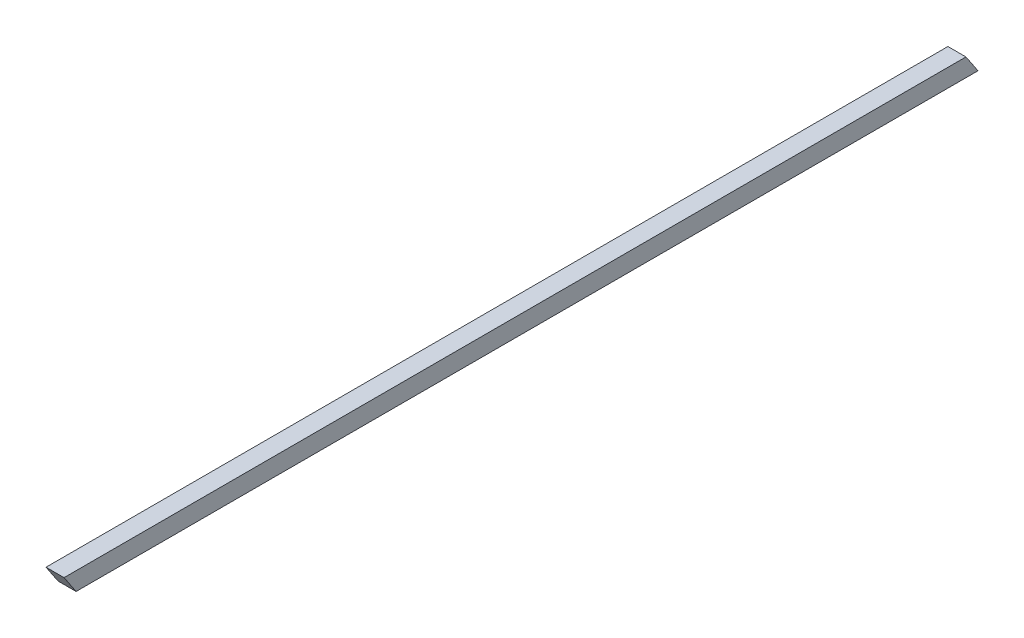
ISO-10303-21;
HEADER;
FILE_DESCRIPTION(('STEP AP214'),'2;1');
FILE_NAME('part.step','',(''),(''),'','','');
FILE_SCHEMA(('AUTOMOTIVE_DESIGN { 1 0 10303 214 1 1 1 1 }'));
ENDSEC;
DATA;
#1=APPLICATION_CONTEXT('core data for automotive mechanical design processes');
#2=APPLICATION_PROTOCOL_DEFINITION('international standard','automotive_design',2000,#1);
#3=PRODUCT_CONTEXT('',#1,'mechanical');
#4=PRODUCT('Part','Part','',(#3));
#5=PRODUCT_RELATED_PRODUCT_CATEGORY('part','',(#4));
#6=PRODUCT_DEFINITION_FORMATION('','',#4);
#7=PRODUCT_DEFINITION_CONTEXT('part definition',#1,'design');
#8=PRODUCT_DEFINITION('design','',#6,#7);
#9=PRODUCT_DEFINITION_SHAPE('','',#8);
#10=(LENGTH_UNIT() NAMED_UNIT(*) SI_UNIT(.MILLI.,.METRE.));
#11=(NAMED_UNIT(*) PLANE_ANGLE_UNIT() SI_UNIT($,.RADIAN.));
#12=(NAMED_UNIT(*) SI_UNIT($,.STERADIAN.) SOLID_ANGLE_UNIT());
#13=UNCERTAINTY_MEASURE_WITH_UNIT(LENGTH_MEASURE(1.E-05),#10,'distance_accuracy_value','');
#14=(GEOMETRIC_REPRESENTATION_CONTEXT(3) GLOBAL_UNCERTAINTY_ASSIGNED_CONTEXT((#13)) GLOBAL_UNIT_ASSIGNED_CONTEXT((#10,
#11,#12)) REPRESENTATION_CONTEXT('',''));
#15=CARTESIAN_POINT('',(0.,0.,0.));
#16=DIRECTION('',(0.,0.,1.));
#17=DIRECTION('',(1.,0.,0.));
#18=AXIS2_PLACEMENT_3D('',#15,#16,#17);
#19=CARTESIAN_POINT('',(-2.,2.,100.));
#20=DIRECTION('',(1.,0.,0.));
#21=DIRECTION('',(0.,0.,-1.));
#22=AXIS2_PLACEMENT_3D('',#19,#20,#21);
#23=PLANE('',#22);
#24=DIRECTION('',(0.,0.,-1.));
#25=VECTOR('',#24,1.);
#26=CARTESIAN_POINT('',(-2.,2.,100.));
#27=LINE('',#26,#25);
#28=CARTESIAN_POINT('',(-2.,2.,102.674337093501));
#29=VERTEX_POINT('',#28);
#30=CARTESIAN_POINT('',(-2.,2.,-97.3256629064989));
#31=VERTEX_POINT('',#30);
#32=EDGE_CURVE('E65',#29,#31,#27,.T.);
#33=ORIENTED_EDGE('',*,*,#32,.T.);
#34=DIRECTION('',(0.,0.831313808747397,0.555803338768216));
#35=VECTOR('',#34,1.);
#36=CARTESIAN_POINT('',(-2.,-2.,-100.));
#37=LINE('',#36,#35);
#38=CARTESIAN_POINT('',(-2.,-2.,-100.));
#39=VERTEX_POINT('',#38);
#40=EDGE_CURVE('E83',#39,#31,#37,.T.);
#41=ORIENTED_EDGE('',*,*,#40,.F.);
#42=DIRECTION('',(0.,0.,-1.));
#43=VECTOR('',#42,1.);
#44=CARTESIAN_POINT('',(-2.,-2.,100.));
#45=LINE('',#44,#43);
#46=CARTESIAN_POINT('',(-2.,-2.,100.));
#47=VERTEX_POINT('',#46);
#48=EDGE_CURVE('E11',#47,#39,#45,.T.);
#49=ORIENTED_EDGE('',*,*,#48,.F.);
#50=DIRECTION('',(0.,0.831313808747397,0.555803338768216));
#51=VECTOR('',#50,1.);
#52=CARTESIAN_POINT('',(-2.,2.,102.674337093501));
#53=LINE('',#52,#51);
#54=EDGE_CURVE('E80',#47,#29,#53,.T.);
#55=ORIENTED_EDGE('',*,*,#54,.T.);
#56=EDGE_LOOP('',(#33,#41,#49,#55));
#57=FACE_BOUND('',#56,.T.);
#58=ADVANCED_FACE('F26',(#57),#23,.F.);
#59=CARTESIAN_POINT('',(-2.,-2.,100.));
#60=DIRECTION('',(0.,1.,0.));
#61=DIRECTION('',(0.,0.,1.));
#62=AXIS2_PLACEMENT_3D('',#59,#60,#61);
#63=PLANE('',#62);
#64=DIRECTION('',(1.,0.,0.));
#65=VECTOR('',#64,1.);
#66=CARTESIAN_POINT('',(-2.,-2.,-100.));
#67=LINE('',#66,#65);
#68=CARTESIAN_POINT('',(2.,-2.,-100.));
#69=VERTEX_POINT('',#68);
#70=EDGE_CURVE('E93',#39,#69,#67,.T.);
#71=ORIENTED_EDGE('',*,*,#70,.T.);
#72=DIRECTION('',(0.,0.,-1.));
#73=VECTOR('',#72,1.);
#74=CARTESIAN_POINT('',(2.,-2.,100.));
#75=LINE('',#74,#73);
#76=CARTESIAN_POINT('',(2.,-2.,100.));
#77=VERTEX_POINT('',#76);
#78=EDGE_CURVE('E33',#77,#69,#75,.T.);
#79=ORIENTED_EDGE('',*,*,#78,.F.);
#80=DIRECTION('',(1.,0.,0.));
#81=VECTOR('',#80,1.);
#82=CARTESIAN_POINT('',(-2.,-2.,100.));
#83=LINE('',#82,#81);
#84=EDGE_CURVE('E42',#47,#77,#83,.T.);
#85=ORIENTED_EDGE('',*,*,#84,.F.);
#86=ORIENTED_EDGE('',*,*,#48,.T.);
#87=EDGE_LOOP('',(#71,#79,#85,#86));
#88=FACE_BOUND('',#87,.T.);
#89=ADVANCED_FACE('F100',(#88),#63,.F.);
#90=CARTESIAN_POINT('',(2.,2.,100.));
#91=DIRECTION('',(-1.,0.,0.));
#92=DIRECTION('',(0.,-1.,0.));
#93=AXIS2_PLACEMENT_3D('',#90,#91,#92);
#94=PLANE('',#93);
#95=ORIENTED_EDGE('',*,*,#78,.T.);
#96=DIRECTION('',(0.,0.831313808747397,0.555803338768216));
#97=VECTOR('',#96,1.);
#98=CARTESIAN_POINT('',(1.99999999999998,93.1737286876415,-36.3683417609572));
#99=LINE('',#98,#97);
#100=CARTESIAN_POINT('',(2.,2.,-97.3256629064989));
#101=VERTEX_POINT('',#100);
#102=EDGE_CURVE('E90',#69,#101,#99,.T.);
#103=ORIENTED_EDGE('',*,*,#102,.T.);
#104=DIRECTION('',(0.,0.,-1.));
#105=VECTOR('',#104,1.);
#106=CARTESIAN_POINT('',(2.,2.,100.));
#107=LINE('',#106,#105);
#108=CARTESIAN_POINT('',(2.,2.,102.674337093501));
#109=VERTEX_POINT('',#108);
#110=EDGE_CURVE('E75',#109,#101,#107,.T.);
#111=ORIENTED_EDGE('',*,*,#110,.F.);
#112=DIRECTION('',(0.,0.831313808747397,0.555803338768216));
#113=VECTOR('',#112,1.);
#114=CARTESIAN_POINT('',(2.,2.,102.674337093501));
#115=LINE('',#114,#113);
#116=EDGE_CURVE('E82',#77,#109,#115,.T.);
#117=ORIENTED_EDGE('',*,*,#116,.F.);
#118=EDGE_LOOP('',(#95,#103,#111,#117));
#119=FACE_BOUND('',#118,.T.);
#120=ADVANCED_FACE('F97',(#119),#94,.F.);
#121=CARTESIAN_POINT('',(-2.,2.,100.));
#122=DIRECTION('',(0.,-1.,0.));
#123=DIRECTION('',(1.,0.,0.));
#124=AXIS2_PLACEMENT_3D('',#121,#122,#123);
#125=PLANE('',#124);
#126=ORIENTED_EDGE('',*,*,#110,.T.);
#127=DIRECTION('',(-1.,0.,0.));
#128=VECTOR('',#127,1.);
#129=CARTESIAN_POINT('',(298.,2.,-97.3256629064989));
#130=LINE('',#129,#128);
#131=EDGE_CURVE('E71',#101,#31,#130,.T.);
#132=ORIENTED_EDGE('',*,*,#131,.T.);
#133=ORIENTED_EDGE('',*,*,#32,.F.);
#134=DIRECTION('',(-1.,0.,0.));
#135=VECTOR('',#134,1.);
#136=CARTESIAN_POINT('',(2.,2.,102.674337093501));
#137=LINE('',#136,#135);
#138=EDGE_CURVE('E69',#109,#29,#137,.T.);
#139=ORIENTED_EDGE('',*,*,#138,.F.);
#140=EDGE_LOOP('',(#126,#132,#133,#139));
#141=FACE_BOUND('',#140,.T.);
#142=ADVANCED_FACE('F68',(#141),#125,.F.);
#143=CARTESIAN_POINT('',(298.,-2.,-100.));
#144=DIRECTION('',(0.,-0.555803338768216,0.831313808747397));
#145=DIRECTION('',(0.,-0.831313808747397,-0.555803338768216));
#146=AXIS2_PLACEMENT_3D('',#143,#144,#145);
#147=PLANE('',#146);
#148=ORIENTED_EDGE('',*,*,#70,.F.);
#149=ORIENTED_EDGE('',*,*,#40,.T.);
#150=ORIENTED_EDGE('',*,*,#131,.F.);
#151=ORIENTED_EDGE('',*,*,#102,.F.);
#152=EDGE_LOOP('',(#148,#149,#150,#151));
#153=FACE_BOUND('',#152,.T.);
#154=ADVANCED_FACE('F99',(#153),#147,.F.);
#155=CARTESIAN_POINT('',(2.,2.,102.674337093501));
#156=DIRECTION('',(0.,-0.555803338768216,0.831313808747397));
#157=DIRECTION('',(0.,-0.831313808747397,-0.555803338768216));
#158=AXIS2_PLACEMENT_3D('',#155,#156,#157);
#159=PLANE('',#158);
#160=ORIENTED_EDGE('',*,*,#54,.F.);
#161=ORIENTED_EDGE('',*,*,#84,.T.);
#162=ORIENTED_EDGE('',*,*,#116,.T.);
#163=ORIENTED_EDGE('',*,*,#138,.T.);
#164=EDGE_LOOP('',(#160,#161,#162,#163));
#165=FACE_BOUND('',#164,.T.);
#166=ADVANCED_FACE('F79',(#165),#159,.T.);
#167=CLOSED_SHELL('',(#58,#89,#120,#142,#154,#166));
#168=MANIFOLD_SOLID_BREP('B2',#167);
#169=ADVANCED_BREP_SHAPE_REPRESENTATION('',(#18,#168),#14);
#170=SHAPE_DEFINITION_REPRESENTATION(#9,#169);
ENDSEC;
END-ISO-10303-21;
